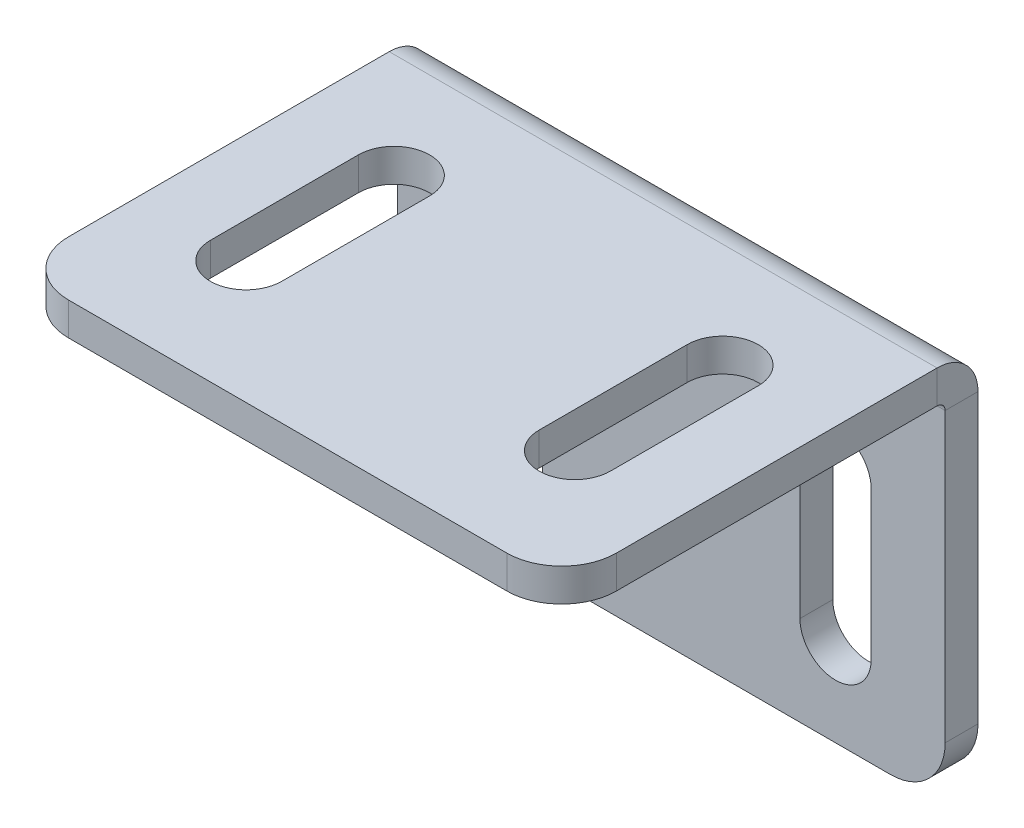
ISO-10303-21;
HEADER;
FILE_DESCRIPTION(('STEP AP214'),'2;1');
FILE_NAME('part.step','',(''),(''),'','','');
FILE_SCHEMA(('AUTOMOTIVE_DESIGN { 1 0 10303 214 1 1 1 1 }'));
ENDSEC;
DATA;
#1=APPLICATION_CONTEXT('core data for automotive mechanical design processes');
#2=APPLICATION_PROTOCOL_DEFINITION('international standard','automotive_design',2000,#1);
#3=PRODUCT_CONTEXT('',#1,'mechanical');
#4=PRODUCT('Part','Part','',(#3));
#5=PRODUCT_RELATED_PRODUCT_CATEGORY('part','',(#4));
#6=PRODUCT_DEFINITION_FORMATION('','',#4);
#7=PRODUCT_DEFINITION_CONTEXT('part definition',#1,'design');
#8=PRODUCT_DEFINITION('design','',#6,#7);
#9=PRODUCT_DEFINITION_SHAPE('','',#8);
#10=(LENGTH_UNIT() NAMED_UNIT(*) SI_UNIT(.MILLI.,.METRE.));
#11=(NAMED_UNIT(*) PLANE_ANGLE_UNIT() SI_UNIT($,.RADIAN.));
#12=(NAMED_UNIT(*) SI_UNIT($,.STERADIAN.) SOLID_ANGLE_UNIT());
#13=UNCERTAINTY_MEASURE_WITH_UNIT(LENGTH_MEASURE(1.E-05),#10,'distance_accuracy_value','');
#14=(GEOMETRIC_REPRESENTATION_CONTEXT(3) GLOBAL_UNCERTAINTY_ASSIGNED_CONTEXT((#13)) GLOBAL_UNIT_ASSIGNED_CONTEXT((#10,
#11,#12)) REPRESENTATION_CONTEXT('',''));
#15=CARTESIAN_POINT('',(0.,0.,0.));
#16=DIRECTION('',(0.,0.,1.));
#17=DIRECTION('',(1.,0.,0.));
#18=AXIS2_PLACEMENT_3D('',#15,#16,#17);
#19=CARTESIAN_POINT('',(0.,0.,3.));
#20=DIRECTION('',(1.,0.,0.));
#21=DIRECTION('',(0.,0.,-1.));
#22=AXIS2_PLACEMENT_3D('',#19,#20,#21);
#23=PLANE('',#22);
#24=DIRECTION('',(0.,-1.,0.));
#25=VECTOR('',#24,1.);
#26=CARTESIAN_POINT('',(0.,0.,0.));
#27=LINE('',#26,#25);
#28=CARTESIAN_POINT('',(0.,31.2634,0.));
#29=VERTEX_POINT('',#28);
#30=CARTESIAN_POINT('',(0.,5.,0.));
#31=VERTEX_POINT('',#30);
#32=EDGE_CURVE('E418',#29,#31,#27,.T.);
#33=ORIENTED_EDGE('',*,*,#32,.T.);
#34=DIRECTION('',(0.,0.,-1.));
#35=VECTOR('',#34,1.);
#36=CARTESIAN_POINT('',(0.,5.,3.));
#37=LINE('',#36,#35);
#38=CARTESIAN_POINT('',(0.,5.,3.));
#39=VERTEX_POINT('',#38);
#40=EDGE_CURVE('E452',#31,#39,#37,.F.);
#41=ORIENTED_EDGE('',*,*,#40,.T.);
#42=DIRECTION('',(0.,-1.,0.));
#43=VECTOR('',#42,1.);
#44=CARTESIAN_POINT('',(0.,0.,3.));
#45=LINE('',#44,#43);
#46=CARTESIAN_POINT('',(0.,31.2634,3.00000000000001));
#47=VERTEX_POINT('',#46);
#48=EDGE_CURVE('E421',#47,#39,#45,.T.);
#49=ORIENTED_EDGE('',*,*,#48,.F.);
#50=DIRECTION('',(0.,0.,-1.));
#51=VECTOR('',#50,1.);
#52=CARTESIAN_POINT('',(0.,31.2634,3.00000000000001));
#53=LINE('',#52,#51);
#54=EDGE_CURVE('E404',#47,#29,#53,.T.);
#55=ORIENTED_EDGE('',*,*,#54,.T.);
#56=EDGE_LOOP('',(#33,#41,#49,#55));
#57=FACE_BOUND('',#56,.T.);
#58=ADVANCED_FACE('F54',(#57),#23,.F.);
#59=CARTESIAN_POINT('',(50.,0.,3.));
#60=DIRECTION('',(-1.,0.,0.));
#61=DIRECTION('',(0.,0.,1.));
#62=AXIS2_PLACEMENT_3D('',#59,#60,#61);
#63=PLANE('',#62);
#64=DIRECTION('',(0.,1.,0.));
#65=VECTOR('',#64,1.);
#66=CARTESIAN_POINT('',(50.,0.,3.));
#67=LINE('',#66,#65);
#68=CARTESIAN_POINT('',(50.,5.,3.));
#69=VERTEX_POINT('',#68);
#70=CARTESIAN_POINT('',(50.,31.2634,3.00000000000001));
#71=VERTEX_POINT('',#70);
#72=EDGE_CURVE('E428',#69,#71,#67,.T.);
#73=ORIENTED_EDGE('',*,*,#72,.F.);
#74=DIRECTION('',(0.,0.,-1.));
#75=VECTOR('',#74,1.);
#76=CARTESIAN_POINT('',(50.,5.,3.));
#77=LINE('',#76,#75);
#78=CARTESIAN_POINT('',(50.,5.,0.));
#79=VERTEX_POINT('',#78);
#80=EDGE_CURVE('E430',#69,#79,#77,.T.);
#81=ORIENTED_EDGE('',*,*,#80,.T.);
#82=DIRECTION('',(0.,1.,0.));
#83=VECTOR('',#82,1.);
#84=CARTESIAN_POINT('',(50.,0.,0.));
#85=LINE('',#84,#83);
#86=CARTESIAN_POINT('',(50.,31.2634,0.));
#87=VERTEX_POINT('',#86);
#88=EDGE_CURVE('E425',#79,#87,#85,.T.);
#89=ORIENTED_EDGE('',*,*,#88,.T.);
#90=DIRECTION('',(0.,0.,-1.));
#91=VECTOR('',#90,1.);
#92=CARTESIAN_POINT('',(50.,31.2634,3.00000000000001));
#93=LINE('',#92,#91);
#94=EDGE_CURVE('E415',#71,#87,#93,.T.);
#95=ORIENTED_EDGE('',*,*,#94,.F.);
#96=EDGE_LOOP('',(#73,#81,#89,#95));
#97=FACE_BOUND('',#96,.T.);
#98=ADVANCED_FACE('F530',(#97),#63,.F.);
#99=CARTESIAN_POINT('',(0.,35.,3.));
#100=DIRECTION('',(0.,0.,-1.));
#101=DIRECTION('',(-1.,0.,0.));
#102=AXIS2_PLACEMENT_3D('',#99,#100,#101);
#103=PLANE('',#102);
#104=DIRECTION('',(0.,1.,0.));
#105=VECTOR('',#104,1.);
#106=CARTESIAN_POINT('',(13.25,8.20000000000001,3.));
#107=LINE('',#106,#105);
#108=CARTESIAN_POINT('',(13.25,8.20000000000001,3.));
#109=VERTEX_POINT('',#108);
#110=CARTESIAN_POINT('',(13.25,21.7,3.));
#111=VERTEX_POINT('',#110);
#112=EDGE_CURVE('E258',#109,#111,#107,.T.);
#113=ORIENTED_EDGE('',*,*,#112,.F.);
#114=CARTESIAN_POINT('',(10.,8.20000000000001,3.));
#115=DIRECTION('',(0.,0.,-1.));
#116=DIRECTION('',(-1.,0.,0.));
#117=AXIS2_PLACEMENT_3D('',#114,#115,#116);
#118=CIRCLE('',#117,3.25);
#119=CARTESIAN_POINT('',(6.75,8.20000000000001,3.));
#120=VERTEX_POINT('',#119);
#121=EDGE_CURVE('E240',#120,#109,#118,.F.);
#122=ORIENTED_EDGE('',*,*,#121,.F.);
#123=DIRECTION('',(0.,-1.,0.));
#124=VECTOR('',#123,1.);
#125=CARTESIAN_POINT('',(6.75,8.20000000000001,3.));
#126=LINE('',#125,#124);
#127=CARTESIAN_POINT('',(6.75,21.7,3.));
#128=VERTEX_POINT('',#127);
#129=EDGE_CURVE('E249',#128,#120,#126,.T.);
#130=ORIENTED_EDGE('',*,*,#129,.F.);
#131=CARTESIAN_POINT('',(10.,21.7,3.));
#132=DIRECTION('',(0.,0.,-1.));
#133=DIRECTION('',(-1.,0.,0.));
#134=AXIS2_PLACEMENT_3D('',#131,#132,#133);
#135=CIRCLE('',#134,3.25);
#136=EDGE_CURVE('E69',#111,#128,#135,.F.);
#137=ORIENTED_EDGE('',*,*,#136,.F.);
#138=EDGE_LOOP('',(#113,#122,#130,#137));
#139=FACE_BOUND('',#138,.T.);
#140=DIRECTION('',(0.,1.,0.));
#141=VECTOR('',#140,1.);
#142=CARTESIAN_POINT('',(43.25,8.2,3.));
#143=LINE('',#142,#141);
#144=CARTESIAN_POINT('',(43.25,8.2,3.));
#145=VERTEX_POINT('',#144);
#146=CARTESIAN_POINT('',(43.25,21.7,3.));
#147=VERTEX_POINT('',#146);
#148=EDGE_CURVE('E276',#145,#147,#143,.T.);
#149=ORIENTED_EDGE('',*,*,#148,.F.);
#150=CARTESIAN_POINT('',(40.,8.2,3.));
#151=DIRECTION('',(0.,0.,-1.));
#152=DIRECTION('',(-1.,0.,0.));
#153=AXIS2_PLACEMENT_3D('',#150,#151,#152);
#154=CIRCLE('',#153,3.25);
#155=CARTESIAN_POINT('',(36.75,8.2,3.));
#156=VERTEX_POINT('',#155);
#157=EDGE_CURVE('E279',#156,#145,#154,.F.);
#158=ORIENTED_EDGE('',*,*,#157,.F.);
#159=DIRECTION('',(0.,-1.,0.));
#160=VECTOR('',#159,1.);
#161=CARTESIAN_POINT('',(36.75,8.2,3.));
#162=LINE('',#161,#160);
#163=CARTESIAN_POINT('',(36.75,21.7,3.));
#164=VERTEX_POINT('',#163);
#165=EDGE_CURVE('E296',#164,#156,#162,.T.);
#166=ORIENTED_EDGE('',*,*,#165,.F.);
#167=CARTESIAN_POINT('',(40.,21.7,3.));
#168=DIRECTION('',(0.,0.,-1.));
#169=DIRECTION('',(-1.,0.,0.));
#170=AXIS2_PLACEMENT_3D('',#167,#168,#169);
#171=CIRCLE('',#170,3.25);
#172=EDGE_CURVE('E252',#147,#164,#171,.F.);
#173=ORIENTED_EDGE('',*,*,#172,.F.);
#174=EDGE_LOOP('',(#149,#158,#166,#173));
#175=FACE_BOUND('',#174,.T.);
#176=DIRECTION('',(1.,0.,0.));
#177=VECTOR('',#176,1.);
#178=CARTESIAN_POINT('',(0.,0.,3.));
#179=LINE('',#178,#177);
#180=CARTESIAN_POINT('',(5.,0.,3.));
#181=VERTEX_POINT('',#180);
#182=CARTESIAN_POINT('',(45.,0.,3.));
#183=VERTEX_POINT('',#182);
#184=EDGE_CURVE('E424',#181,#183,#179,.T.);
#185=ORIENTED_EDGE('',*,*,#184,.T.);
#186=CARTESIAN_POINT('',(45.,5.,3.));
#187=DIRECTION('',(0.,0.,-1.));
#188=DIRECTION('',(-1.,0.,0.));
#189=AXIS2_PLACEMENT_3D('',#186,#187,#188);
#190=CIRCLE('',#189,5.);
#191=EDGE_CURVE('E450',#183,#69,#190,.F.);
#192=ORIENTED_EDGE('',*,*,#191,.T.);
#193=ORIENTED_EDGE('',*,*,#72,.T.);
#194=DIRECTION('',(-1.,0.,0.));
#195=VECTOR('',#194,1.);
#196=CARTESIAN_POINT('',(0.,31.2634,3.00000000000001));
#197=LINE('',#196,#195);
#198=EDGE_CURVE('E410',#47,#71,#197,.F.);
#199=ORIENTED_EDGE('',*,*,#198,.F.);
#200=ORIENTED_EDGE('',*,*,#48,.T.);
#201=CARTESIAN_POINT('',(5.,5.,3.));
#202=DIRECTION('',(0.,0.,-1.));
#203=DIRECTION('',(-1.,0.,0.));
#204=AXIS2_PLACEMENT_3D('',#201,#202,#203);
#205=CIRCLE('',#204,5.);
#206=EDGE_CURVE('E448',#39,#181,#205,.F.);
#207=ORIENTED_EDGE('',*,*,#206,.T.);
#208=EDGE_LOOP('',(#185,#192,#193,#199,#200,#207));
#209=FACE_BOUND('',#208,.T.);
#210=ADVANCED_FACE('F255',(#139,#175,#209),#103,.F.);
#211=CARTESIAN_POINT('',(0.,35.,0.));
#212=DIRECTION('',(0.,0.,-1.));
#213=DIRECTION('',(-1.,0.,0.));
#214=AXIS2_PLACEMENT_3D('',#211,#212,#213);
#215=PLANE('',#214);
#216=CARTESIAN_POINT('',(10.,8.20000000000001,0.));
#217=DIRECTION('',(0.,0.,-1.));
#218=DIRECTION('',(-1.,0.,0.));
#219=AXIS2_PLACEMENT_3D('',#216,#217,#218);
#220=CIRCLE('',#219,3.25);
#221=CARTESIAN_POINT('',(13.25,8.20000000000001,0.));
#222=VERTEX_POINT('',#221);
#223=CARTESIAN_POINT('',(6.75,8.20000000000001,0.));
#224=VERTEX_POINT('',#223);
#225=EDGE_CURVE('E77',#222,#224,#220,.T.);
#226=ORIENTED_EDGE('',*,*,#225,.F.);
#227=DIRECTION('',(0.,-1.,0.));
#228=VECTOR('',#227,1.);
#229=CARTESIAN_POINT('',(13.25,8.20000000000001,0.));
#230=LINE('',#229,#228);
#231=CARTESIAN_POINT('',(13.25,21.7,0.));
#232=VERTEX_POINT('',#231);
#233=EDGE_CURVE('E246',#232,#222,#230,.T.);
#234=ORIENTED_EDGE('',*,*,#233,.F.);
#235=CARTESIAN_POINT('',(10.,21.7,0.));
#236=DIRECTION('',(0.,0.,-1.));
#237=DIRECTION('',(-1.,0.,0.));
#238=AXIS2_PLACEMENT_3D('',#235,#236,#237);
#239=CIRCLE('',#238,3.25);
#240=CARTESIAN_POINT('',(6.75,21.7,0.));
#241=VERTEX_POINT('',#240);
#242=EDGE_CURVE('E266',#241,#232,#239,.T.);
#243=ORIENTED_EDGE('',*,*,#242,.F.);
#244=DIRECTION('',(0.,1.,0.));
#245=VECTOR('',#244,1.);
#246=CARTESIAN_POINT('',(6.75,8.20000000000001,0.));
#247=LINE('',#246,#245);
#248=EDGE_CURVE('E260',#224,#241,#247,.T.);
#249=ORIENTED_EDGE('',*,*,#248,.F.);
#250=EDGE_LOOP('',(#226,#234,#243,#249));
#251=FACE_BOUND('',#250,.T.);
#252=CARTESIAN_POINT('',(40.,8.2,0.));
#253=DIRECTION('',(0.,0.,-1.));
#254=DIRECTION('',(-1.,0.,0.));
#255=AXIS2_PLACEMENT_3D('',#252,#253,#254);
#256=CIRCLE('',#255,3.25);
#257=CARTESIAN_POINT('',(43.25,8.2,0.));
#258=VERTEX_POINT('',#257);
#259=CARTESIAN_POINT('',(36.75,8.20000000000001,0.));
#260=VERTEX_POINT('',#259);
#261=EDGE_CURVE('E282',#258,#260,#256,.T.);
#262=ORIENTED_EDGE('',*,*,#261,.F.);
#263=DIRECTION('',(0.,-1.,0.));
#264=VECTOR('',#263,1.);
#265=CARTESIAN_POINT('',(43.25,8.2,0.));
#266=LINE('',#265,#264);
#267=CARTESIAN_POINT('',(43.25,21.7,0.));
#268=VERTEX_POINT('',#267);
#269=EDGE_CURVE('E290',#268,#258,#266,.T.);
#270=ORIENTED_EDGE('',*,*,#269,.F.);
#271=CARTESIAN_POINT('',(40.,21.7,0.));
#272=DIRECTION('',(0.,0.,-1.));
#273=DIRECTION('',(-1.,0.,0.));
#274=AXIS2_PLACEMENT_3D('',#271,#272,#273);
#275=CIRCLE('',#274,3.25);
#276=CARTESIAN_POINT('',(36.75,21.7,0.));
#277=VERTEX_POINT('',#276);
#278=EDGE_CURVE('E287',#277,#268,#275,.T.);
#279=ORIENTED_EDGE('',*,*,#278,.F.);
#280=DIRECTION('',(0.,1.,0.));
#281=VECTOR('',#280,1.);
#282=CARTESIAN_POINT('',(36.75,8.2,0.));
#283=LINE('',#282,#281);
#284=EDGE_CURVE('E284',#260,#277,#283,.T.);
#285=ORIENTED_EDGE('',*,*,#284,.F.);
#286=EDGE_LOOP('',(#262,#270,#279,#285));
#287=FACE_BOUND('',#286,.T.);
#288=ORIENTED_EDGE('',*,*,#88,.F.);
#289=CARTESIAN_POINT('',(45.,5.,0.));
#290=DIRECTION('',(0.,0.,-1.));
#291=DIRECTION('',(-1.,0.,0.));
#292=AXIS2_PLACEMENT_3D('',#289,#290,#291);
#293=CIRCLE('',#292,5.);
#294=CARTESIAN_POINT('',(45.,0.,0.));
#295=VERTEX_POINT('',#294);
#296=EDGE_CURVE('E441',#79,#295,#293,.T.);
#297=ORIENTED_EDGE('',*,*,#296,.T.);
#298=DIRECTION('',(1.,0.,0.));
#299=VECTOR('',#298,1.);
#300=CARTESIAN_POINT('',(0.,0.,0.));
#301=LINE('',#300,#299);
#302=CARTESIAN_POINT('',(5.,0.,0.));
#303=VERTEX_POINT('',#302);
#304=EDGE_CURVE('E433',#303,#295,#301,.T.);
#305=ORIENTED_EDGE('',*,*,#304,.F.);
#306=CARTESIAN_POINT('',(5.,5.,0.));
#307=DIRECTION('',(0.,0.,-1.));
#308=DIRECTION('',(-1.,0.,0.));
#309=AXIS2_PLACEMENT_3D('',#306,#307,#308);
#310=CIRCLE('',#309,5.);
#311=EDGE_CURVE('E439',#303,#31,#310,.T.);
#312=ORIENTED_EDGE('',*,*,#311,.T.);
#313=ORIENTED_EDGE('',*,*,#32,.F.);
#314=DIRECTION('',(-1.,0.,0.));
#315=VECTOR('',#314,1.);
#316=CARTESIAN_POINT('',(0.,31.2634,0.));
#317=LINE('',#316,#315);
#318=EDGE_CURVE('E397',#29,#87,#317,.F.);
#319=ORIENTED_EDGE('',*,*,#318,.T.);
#320=EDGE_LOOP('',(#288,#297,#305,#312,#313,#319));
#321=FACE_BOUND('',#320,.T.);
#322=ADVANCED_FACE('F511',(#251,#287,#321),#215,.T.);
#323=CARTESIAN_POINT('',(0.,0.,3.));
#324=DIRECTION('',(0.,1.,0.));
#325=DIRECTION('',(0.,0.,1.));
#326=AXIS2_PLACEMENT_3D('',#323,#324,#325);
#327=PLANE('',#326);
#328=ORIENTED_EDGE('',*,*,#304,.T.);
#329=DIRECTION('',(0.,0.,-1.));
#330=VECTOR('',#329,1.);
#331=CARTESIAN_POINT('',(45.,0.,3.));
#332=LINE('',#331,#330);
#333=EDGE_CURVE('E446',#295,#183,#332,.F.);
#334=ORIENTED_EDGE('',*,*,#333,.T.);
#335=ORIENTED_EDGE('',*,*,#184,.F.);
#336=DIRECTION('',(0.,0.,-1.));
#337=VECTOR('',#336,1.);
#338=CARTESIAN_POINT('',(5.,0.,3.));
#339=LINE('',#338,#337);
#340=EDGE_CURVE('E443',#181,#303,#339,.T.);
#341=ORIENTED_EDGE('',*,*,#340,.T.);
#342=EDGE_LOOP('',(#328,#334,#335,#341));
#343=FACE_BOUND('',#342,.T.);
#344=ADVANCED_FACE('F525',(#343),#327,.F.);
#345=CARTESIAN_POINT('',(50.,31.2634,3.7366));
#346=DIRECTION('',(1.,0.,0.));
#347=DIRECTION('',(0.,0.,-1.));
#348=AXIS2_PLACEMENT_3D('',#345,#346,#347);
#349=PLANE('',#348);
#350=DIRECTION('',(0.,-1.,0.));
#351=VECTOR('',#350,1.);
#352=CARTESIAN_POINT('',(50.,35.,3.73659999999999));
#353=LINE('',#352,#351);
#354=CARTESIAN_POINT('',(50.,32.,3.7366));
#355=VERTEX_POINT('',#354);
#356=CARTESIAN_POINT('',(50.,35.,3.73659999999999));
#357=VERTEX_POINT('',#356);
#358=EDGE_CURVE('E369',#355,#357,#353,.F.);
#359=ORIENTED_EDGE('',*,*,#358,.F.);
#360=CARTESIAN_POINT('',(50.,31.2634,3.7366));
#361=DIRECTION('',(-1.,0.,0.));
#362=DIRECTION('',(0.,0.,1.));
#363=AXIS2_PLACEMENT_3D('',#360,#361,#362);
#364=CIRCLE('',#363,0.736599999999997);
#365=EDGE_CURVE('E407',#71,#355,#364,.F.);
#366=ORIENTED_EDGE('',*,*,#365,.F.);
#367=ORIENTED_EDGE('',*,*,#94,.T.);
#368=CARTESIAN_POINT('',(50.,31.2634,3.7366));
#369=DIRECTION('',(-1.,0.,0.));
#370=DIRECTION('',(0.,0.,1.));
#371=AXIS2_PLACEMENT_3D('',#368,#369,#370);
#372=CIRCLE('',#371,3.7366);
#373=EDGE_CURVE('E400',#87,#357,#372,.F.);
#374=ORIENTED_EDGE('',*,*,#373,.T.);
#375=EDGE_LOOP('',(#359,#366,#367,#374));
#376=FACE_BOUND('',#375,.T.);
#377=ADVANCED_FACE('F503',(#376),#349,.T.);
#378=CARTESIAN_POINT('',(0.,31.2634,3.7366));
#379=DIRECTION('',(1.,0.,0.));
#380=DIRECTION('',(0.,0.,-1.));
#381=AXIS2_PLACEMENT_3D('',#378,#379,#380);
#382=PLANE('',#381);
#383=CARTESIAN_POINT('',(0.,31.2634,3.7366));
#384=DIRECTION('',(-1.,0.,0.));
#385=DIRECTION('',(0.,0.,1.));
#386=AXIS2_PLACEMENT_3D('',#383,#384,#385);
#387=CIRCLE('',#386,0.736599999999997);
#388=CARTESIAN_POINT('',(0.,32.,3.7366));
#389=VERTEX_POINT('',#388);
#390=EDGE_CURVE('E373',#389,#47,#387,.T.);
#391=ORIENTED_EDGE('',*,*,#390,.F.);
#392=DIRECTION('',(0.,-1.,0.));
#393=VECTOR('',#392,1.);
#394=CARTESIAN_POINT('',(0.,32.,3.7366));
#395=LINE('',#394,#393);
#396=CARTESIAN_POINT('',(0.,35.,3.73659999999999));
#397=VERTEX_POINT('',#396);
#398=EDGE_CURVE('E390',#389,#397,#395,.F.);
#399=ORIENTED_EDGE('',*,*,#398,.T.);
#400=CARTESIAN_POINT('',(0.,31.2634,3.7366));
#401=DIRECTION('',(-1.,0.,0.));
#402=DIRECTION('',(0.,0.,1.));
#403=AXIS2_PLACEMENT_3D('',#400,#401,#402);
#404=CIRCLE('',#403,3.7366);
#405=EDGE_CURVE('E401',#397,#29,#404,.T.);
#406=ORIENTED_EDGE('',*,*,#405,.T.);
#407=ORIENTED_EDGE('',*,*,#54,.F.);
#408=EDGE_LOOP('',(#391,#399,#406,#407));
#409=FACE_BOUND('',#408,.T.);
#410=ADVANCED_FACE('F498',(#409),#382,.F.);
#411=CARTESIAN_POINT('',(0.,31.2634,3.7366));
#412=DIRECTION('',(-1.,0.,0.));
#413=DIRECTION('',(0.,1.,0.));
#414=AXIS2_PLACEMENT_3D('',#411,#412,#413);
#415=CYLINDRICAL_SURFACE('',#414,3.7366);
#416=ORIENTED_EDGE('',*,*,#318,.F.);
#417=ORIENTED_EDGE('',*,*,#405,.F.);
#418=DIRECTION('',(-1.,0.,0.));
#419=VECTOR('',#418,1.);
#420=CARTESIAN_POINT('',(50.,35.,3.73659999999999));
#421=LINE('',#420,#419);
#422=EDGE_CURVE('E387',#397,#357,#421,.F.);
#423=ORIENTED_EDGE('',*,*,#422,.T.);
#424=ORIENTED_EDGE('',*,*,#373,.F.);
#425=EDGE_LOOP('',(#416,#417,#423,#424));
#426=FACE_BOUND('',#425,.T.);
#427=ADVANCED_FACE('F501',(#426),#415,.T.);
#428=CARTESIAN_POINT('',(0.,31.2634,3.7366));
#429=DIRECTION('',(-1.,0.,0.));
#430=DIRECTION('',(0.,1.,0.));
#431=AXIS2_PLACEMENT_3D('',#428,#429,#430);
#432=CYLINDRICAL_SURFACE('',#431,0.736599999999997);
#433=ORIENTED_EDGE('',*,*,#198,.T.);
#434=ORIENTED_EDGE('',*,*,#365,.T.);
#435=DIRECTION('',(-1.,0.,0.));
#436=VECTOR('',#435,1.);
#437=CARTESIAN_POINT('',(50.,32.,3.7366));
#438=LINE('',#437,#436);
#439=EDGE_CURVE('E393',#355,#389,#438,.T.);
#440=ORIENTED_EDGE('',*,*,#439,.T.);
#441=ORIENTED_EDGE('',*,*,#390,.T.);
#442=EDGE_LOOP('',(#433,#434,#440,#441));
#443=FACE_BOUND('',#442,.T.);
#444=ADVANCED_FACE('F579',(#443),#432,.F.);
#445=CARTESIAN_POINT('',(50.,35.,2.99999999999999));
#446=DIRECTION('',(-1.,0.,0.));
#447=DIRECTION('',(0.,0.,1.));
#448=AXIS2_PLACEMENT_3D('',#445,#446,#447);
#449=PLANE('',#448);
#450=DIRECTION('',(0.,0.,-1.));
#451=VECTOR('',#450,1.);
#452=CARTESIAN_POINT('',(50.,35.0000000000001,38.));
#453=LINE('',#452,#451);
#454=CARTESIAN_POINT('',(50.,35.0000000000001,33.));
#455=VERTEX_POINT('',#454);
#456=EDGE_CURVE('E377',#455,#357,#453,.T.);
#457=ORIENTED_EDGE('',*,*,#456,.F.);
#458=DIRECTION('',(0.,-1.,0.));
#459=VECTOR('',#458,1.);
#460=CARTESIAN_POINT('',(50.,35.0000000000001,33.));
#461=LINE('',#460,#459);
#462=CARTESIAN_POINT('',(50.,32.0000000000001,33.));
#463=VERTEX_POINT('',#462);
#464=EDGE_CURVE('E454',#455,#463,#461,.T.);
#465=ORIENTED_EDGE('',*,*,#464,.T.);
#466=DIRECTION('',(0.,0.,1.));
#467=VECTOR('',#466,1.);
#468=CARTESIAN_POINT('',(50.,32.,3.));
#469=LINE('',#468,#467);
#470=EDGE_CURVE('E385',#463,#355,#469,.F.);
#471=ORIENTED_EDGE('',*,*,#470,.T.);
#472=ORIENTED_EDGE('',*,*,#358,.T.);
#473=EDGE_LOOP('',(#457,#465,#471,#472));
#474=FACE_BOUND('',#473,.T.);
#475=ADVANCED_FACE('F477',(#474),#449,.F.);
#476=CARTESIAN_POINT('',(0.,35.0000000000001,38.));
#477=DIRECTION('',(1.,0.,0.));
#478=DIRECTION('',(0.,0.,-1.));
#479=AXIS2_PLACEMENT_3D('',#476,#477,#478);
#480=PLANE('',#479);
#481=DIRECTION('',(0.,0.,-1.));
#482=VECTOR('',#481,1.);
#483=CARTESIAN_POINT('',(0.,32.0000000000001,38.));
#484=LINE('',#483,#482);
#485=CARTESIAN_POINT('',(0.,32.0000000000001,33.));
#486=VERTEX_POINT('',#485);
#487=EDGE_CURVE('E382',#389,#486,#484,.F.);
#488=ORIENTED_EDGE('',*,*,#487,.T.);
#489=DIRECTION('',(0.,-1.,0.));
#490=VECTOR('',#489,1.);
#491=CARTESIAN_POINT('',(0.,35.0000000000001,33.));
#492=LINE('',#491,#490);
#493=CARTESIAN_POINT('',(0.,35.0000000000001,33.));
#494=VERTEX_POINT('',#493);
#495=EDGE_CURVE('E13',#486,#494,#492,.F.);
#496=ORIENTED_EDGE('',*,*,#495,.T.);
#497=DIRECTION('',(0.,0.,1.));
#498=VECTOR('',#497,1.);
#499=CARTESIAN_POINT('',(0.,35.0000000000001,38.));
#500=LINE('',#499,#498);
#501=EDGE_CURVE('E374',#397,#494,#500,.T.);
#502=ORIENTED_EDGE('',*,*,#501,.F.);
#503=ORIENTED_EDGE('',*,*,#398,.F.);
#504=EDGE_LOOP('',(#488,#496,#502,#503));
#505=FACE_BOUND('',#504,.T.);
#506=ADVANCED_FACE('F494',(#505),#480,.F.);
#507=CARTESIAN_POINT('',(50.,35.0000000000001,38.));
#508=DIRECTION('',(0.,-1.,0.));
#509=DIRECTION('',(0.,0.,-1.));
#510=AXIS2_PLACEMENT_3D('',#507,#508,#509);
#511=PLANE('',#510);
#512=DIRECTION('',(0.,0.,-1.));
#513=VECTOR('',#512,1.);
#514=CARTESIAN_POINT('',(43.25,35.0000000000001,26.8));
#515=LINE('',#514,#513);
#516=CARTESIAN_POINT('',(43.25,35.0000000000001,26.8));
#517=VERTEX_POINT('',#516);
#518=CARTESIAN_POINT('',(43.25,35.,13.3));
#519=VERTEX_POINT('',#518);
#520=EDGE_CURVE('E316',#517,#519,#515,.T.);
#521=ORIENTED_EDGE('',*,*,#520,.F.);
#522=CARTESIAN_POINT('',(40.,35.0000000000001,26.8));
#523=DIRECTION('',(0.,1.,0.));
#524=DIRECTION('',(0.,0.,1.));
#525=AXIS2_PLACEMENT_3D('',#522,#523,#524);
#526=CIRCLE('',#525,3.25);
#527=CARTESIAN_POINT('',(36.75,35.0000000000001,26.8));
#528=VERTEX_POINT('',#527);
#529=EDGE_CURVE('E314',#528,#517,#526,.T.);
#530=ORIENTED_EDGE('',*,*,#529,.F.);
#531=DIRECTION('',(0.,0.,1.));
#532=VECTOR('',#531,1.);
#533=CARTESIAN_POINT('',(36.75,35.0000000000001,26.8));
#534=LINE('',#533,#532);
#535=CARTESIAN_POINT('',(36.75,35.,13.3));
#536=VERTEX_POINT('',#535);
#537=EDGE_CURVE('E322',#536,#528,#534,.T.);
#538=ORIENTED_EDGE('',*,*,#537,.F.);
#539=CARTESIAN_POINT('',(40.,35.,13.3));
#540=DIRECTION('',(0.,1.,0.));
#541=DIRECTION('',(0.,0.,1.));
#542=AXIS2_PLACEMENT_3D('',#539,#540,#541);
#543=CIRCLE('',#542,3.25);
#544=EDGE_CURVE('E319',#519,#536,#543,.T.);
#545=ORIENTED_EDGE('',*,*,#544,.F.);
#546=EDGE_LOOP('',(#521,#530,#538,#545));
#547=FACE_BOUND('',#546,.T.);
#548=DIRECTION('',(0.,0.,-1.));
#549=VECTOR('',#548,1.);
#550=CARTESIAN_POINT('',(13.25,35.0000000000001,26.8));
#551=LINE('',#550,#549);
#552=CARTESIAN_POINT('',(13.25,35.0000000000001,26.8));
#553=VERTEX_POINT('',#552);
#554=CARTESIAN_POINT('',(13.25,35.,13.3));
#555=VERTEX_POINT('',#554);
#556=EDGE_CURVE('E348',#553,#555,#551,.T.);
#557=ORIENTED_EDGE('',*,*,#556,.F.);
#558=CARTESIAN_POINT('',(10.,35.0000000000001,26.8));
#559=DIRECTION('',(0.,1.,0.));
#560=DIRECTION('',(0.,0.,1.));
#561=AXIS2_PLACEMENT_3D('',#558,#559,#560);
#562=CIRCLE('',#561,3.25);
#563=CARTESIAN_POINT('',(6.75,35.0000000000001,26.8));
#564=VERTEX_POINT('',#563);
#565=EDGE_CURVE('E346',#564,#553,#562,.T.);
#566=ORIENTED_EDGE('',*,*,#565,.F.);
#567=DIRECTION('',(0.,0.,1.));
#568=VECTOR('',#567,1.);
#569=CARTESIAN_POINT('',(6.75,35.0000000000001,26.8));
#570=LINE('',#569,#568);
#571=CARTESIAN_POINT('',(6.75,35.,13.3));
#572=VERTEX_POINT('',#571);
#573=EDGE_CURVE('E354',#572,#564,#570,.T.);
#574=ORIENTED_EDGE('',*,*,#573,.F.);
#575=CARTESIAN_POINT('',(10.,35.,13.3));
#576=DIRECTION('',(0.,1.,0.));
#577=DIRECTION('',(0.,0.,1.));
#578=AXIS2_PLACEMENT_3D('',#575,#576,#577);
#579=CIRCLE('',#578,3.25);
#580=EDGE_CURVE('E351',#555,#572,#579,.T.);
#581=ORIENTED_EDGE('',*,*,#580,.F.);
#582=EDGE_LOOP('',(#557,#566,#574,#581));
#583=FACE_BOUND('',#582,.T.);
#584=DIRECTION('',(1.,0.,0.));
#585=VECTOR('',#584,1.);
#586=CARTESIAN_POINT('',(50.,35.0000000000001,38.));
#587=LINE('',#586,#585);
#588=CARTESIAN_POINT('',(5.,35.0000000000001,38.));
#589=VERTEX_POINT('',#588);
#590=CARTESIAN_POINT('',(45.,35.0000000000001,38.));
#591=VERTEX_POINT('',#590);
#592=EDGE_CURVE('E370',#589,#591,#587,.T.);
#593=ORIENTED_EDGE('',*,*,#592,.T.);
#594=CARTESIAN_POINT('',(45.,35.0000000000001,33.));
#595=DIRECTION('',(0.,-1.,0.));
#596=DIRECTION('',(0.,0.,-1.));
#597=AXIS2_PLACEMENT_3D('',#594,#595,#596);
#598=CIRCLE('',#597,5.);
#599=EDGE_CURVE('E62',#591,#455,#598,.F.);
#600=ORIENTED_EDGE('',*,*,#599,.T.);
#601=ORIENTED_EDGE('',*,*,#456,.T.);
#602=ORIENTED_EDGE('',*,*,#422,.F.);
#603=ORIENTED_EDGE('',*,*,#501,.T.);
#604=CARTESIAN_POINT('',(5.,35.0000000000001,33.));
#605=DIRECTION('',(0.,-1.,0.));
#606=DIRECTION('',(0.,0.,-1.));
#607=AXIS2_PLACEMENT_3D('',#604,#605,#606);
#608=CIRCLE('',#607,5.);
#609=EDGE_CURVE('E466',#494,#589,#608,.F.);
#610=ORIENTED_EDGE('',*,*,#609,.T.);
#611=EDGE_LOOP('',(#593,#600,#601,#602,#603,#610));
#612=FACE_BOUND('',#611,.T.);
#613=ADVANCED_FACE('F470',(#547,#583,#612),#511,.F.);
#614=CARTESIAN_POINT('',(50.,32.0000000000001,38.));
#615=DIRECTION('',(0.,-1.,0.));
#616=DIRECTION('',(0.,0.,-1.));
#617=AXIS2_PLACEMENT_3D('',#614,#615,#616);
#618=PLANE('',#617);
#619=CARTESIAN_POINT('',(40.,32.0000000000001,26.8));
#620=DIRECTION('',(0.,-1.,0.));
#621=DIRECTION('',(0.,0.,-1.));
#622=AXIS2_PLACEMENT_3D('',#619,#620,#621);
#623=CIRCLE('',#622,3.25);
#624=CARTESIAN_POINT('',(36.75,32.0000000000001,26.8000000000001));
#625=VERTEX_POINT('',#624);
#626=CARTESIAN_POINT('',(43.25,32.0000000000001,26.8000000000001));
#627=VERTEX_POINT('',#626);
#628=EDGE_CURVE('E311',#625,#627,#623,.F.);
#629=ORIENTED_EDGE('',*,*,#628,.T.);
#630=DIRECTION('',(0.,0.,-1.));
#631=VECTOR('',#630,1.);
#632=CARTESIAN_POINT('',(43.25,32.0000000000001,26.8));
#633=LINE('',#632,#631);
#634=CARTESIAN_POINT('',(43.25,32.,13.3));
#635=VERTEX_POINT('',#634);
#636=EDGE_CURVE('E328',#627,#635,#633,.T.);
#637=ORIENTED_EDGE('',*,*,#636,.T.);
#638=CARTESIAN_POINT('',(40.,32.,13.3));
#639=DIRECTION('',(0.,-1.,0.));
#640=DIRECTION('',(0.,0.,-1.));
#641=AXIS2_PLACEMENT_3D('',#638,#639,#640);
#642=CIRCLE('',#641,3.25);
#643=CARTESIAN_POINT('',(36.75,32.,13.3000000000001));
#644=VERTEX_POINT('',#643);
#645=EDGE_CURVE('E305',#635,#644,#642,.F.);
#646=ORIENTED_EDGE('',*,*,#645,.T.);
#647=DIRECTION('',(0.,0.,1.));
#648=VECTOR('',#647,1.);
#649=CARTESIAN_POINT('',(36.75,32.0000000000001,26.8));
#650=LINE('',#649,#648);
#651=EDGE_CURVE('E308',#644,#625,#650,.T.);
#652=ORIENTED_EDGE('',*,*,#651,.T.);
#653=EDGE_LOOP('',(#629,#637,#646,#652));
#654=FACE_BOUND('',#653,.T.);
#655=CARTESIAN_POINT('',(10.,32.0000000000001,26.8));
#656=DIRECTION('',(0.,-1.,0.));
#657=DIRECTION('',(0.,0.,-1.));
#658=AXIS2_PLACEMENT_3D('',#655,#656,#657);
#659=CIRCLE('',#658,3.25);
#660=CARTESIAN_POINT('',(6.75,32.0000000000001,26.8000000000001));
#661=VERTEX_POINT('',#660);
#662=CARTESIAN_POINT('',(13.25,32.0000000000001,26.8000000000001));
#663=VERTEX_POINT('',#662);
#664=EDGE_CURVE('E343',#661,#663,#659,.F.);
#665=ORIENTED_EDGE('',*,*,#664,.T.);
#666=DIRECTION('',(0.,0.,-1.));
#667=VECTOR('',#666,1.);
#668=CARTESIAN_POINT('',(13.25,32.0000000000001,26.8));
#669=LINE('',#668,#667);
#670=CARTESIAN_POINT('',(13.25,32.,13.3));
#671=VERTEX_POINT('',#670);
#672=EDGE_CURVE('E360',#663,#671,#669,.T.);
#673=ORIENTED_EDGE('',*,*,#672,.T.);
#674=CARTESIAN_POINT('',(10.,32.,13.3));
#675=DIRECTION('',(0.,-1.,0.));
#676=DIRECTION('',(0.,0.,-1.));
#677=AXIS2_PLACEMENT_3D('',#674,#675,#676);
#678=CIRCLE('',#677,3.25);
#679=CARTESIAN_POINT('',(6.75,32.,13.3000000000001));
#680=VERTEX_POINT('',#679);
#681=EDGE_CURVE('E337',#671,#680,#678,.F.);
#682=ORIENTED_EDGE('',*,*,#681,.T.);
#683=DIRECTION('',(0.,0.,1.));
#684=VECTOR('',#683,1.);
#685=CARTESIAN_POINT('',(6.75,32.0000000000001,26.8));
#686=LINE('',#685,#684);
#687=EDGE_CURVE('E340',#680,#661,#686,.T.);
#688=ORIENTED_EDGE('',*,*,#687,.T.);
#689=EDGE_LOOP('',(#665,#673,#682,#688));
#690=FACE_BOUND('',#689,.T.);
#691=ORIENTED_EDGE('',*,*,#470,.F.);
#692=CARTESIAN_POINT('',(45.,32.0000000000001,33.));
#693=DIRECTION('',(0.,-1.,0.));
#694=DIRECTION('',(0.,0.,-1.));
#695=AXIS2_PLACEMENT_3D('',#692,#693,#694);
#696=CIRCLE('',#695,5.);
#697=CARTESIAN_POINT('',(45.,32.0000000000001,38.));
#698=VERTEX_POINT('',#697);
#699=EDGE_CURVE('E459',#463,#698,#696,.T.);
#700=ORIENTED_EDGE('',*,*,#699,.T.);
#701=DIRECTION('',(-1.,0.,0.));
#702=VECTOR('',#701,1.);
#703=CARTESIAN_POINT('',(50.,32.0000000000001,38.));
#704=LINE('',#703,#702);
#705=CARTESIAN_POINT('',(5.,32.0000000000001,38.));
#706=VERTEX_POINT('',#705);
#707=EDGE_CURVE('E379',#706,#698,#704,.F.);
#708=ORIENTED_EDGE('',*,*,#707,.F.);
#709=CARTESIAN_POINT('',(5.,32.0000000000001,33.));
#710=DIRECTION('',(0.,-1.,0.));
#711=DIRECTION('',(0.,0.,-1.));
#712=AXIS2_PLACEMENT_3D('',#709,#710,#711);
#713=CIRCLE('',#712,5.);
#714=EDGE_CURVE('E457',#706,#486,#713,.T.);
#715=ORIENTED_EDGE('',*,*,#714,.T.);
#716=ORIENTED_EDGE('',*,*,#487,.F.);
#717=ORIENTED_EDGE('',*,*,#439,.F.);
#718=EDGE_LOOP('',(#691,#700,#708,#715,#716,#717));
#719=FACE_BOUND('',#718,.T.);
#720=ADVANCED_FACE('F483',(#654,#690,#719),#618,.T.);
#721=CARTESIAN_POINT('',(50.,35.0000000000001,38.));
#722=DIRECTION('',(0.,0.,-1.));
#723=DIRECTION('',(0.,1.,0.));
#724=AXIS2_PLACEMENT_3D('',#721,#722,#723);
#725=PLANE('',#724);
#726=ORIENTED_EDGE('',*,*,#707,.T.);
#727=DIRECTION('',(0.,-1.,0.));
#728=VECTOR('',#727,1.);
#729=CARTESIAN_POINT('',(45.,35.0000000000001,38.));
#730=LINE('',#729,#728);
#731=EDGE_CURVE('E464',#698,#591,#730,.F.);
#732=ORIENTED_EDGE('',*,*,#731,.T.);
#733=ORIENTED_EDGE('',*,*,#592,.F.);
#734=DIRECTION('',(0.,-1.,0.));
#735=VECTOR('',#734,1.);
#736=CARTESIAN_POINT('',(5.,35.0000000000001,38.));
#737=LINE('',#736,#735);
#738=EDGE_CURVE('E461',#589,#706,#737,.T.);
#739=ORIENTED_EDGE('',*,*,#738,.T.);
#740=EDGE_LOOP('',(#726,#732,#733,#739));
#741=FACE_BOUND('',#740,.T.);
#742=ADVANCED_FACE('F486',(#741),#725,.F.);
#743=CARTESIAN_POINT('',(45.,5.,3.));
#744=DIRECTION('',(0.,0.,-1.));
#745=DIRECTION('',(-1.,0.,0.));
#746=AXIS2_PLACEMENT_3D('',#743,#744,#745);
#747=CYLINDRICAL_SURFACE('',#746,5.);
#748=ORIENTED_EDGE('',*,*,#191,.F.);
#749=ORIENTED_EDGE('',*,*,#333,.F.);
#750=ORIENTED_EDGE('',*,*,#296,.F.);
#751=ORIENTED_EDGE('',*,*,#80,.F.);
#752=EDGE_LOOP('',(#748,#749,#750,#751));
#753=FACE_BOUND('',#752,.T.);
#754=ADVANCED_FACE('F528',(#753),#747,.T.);
#755=CARTESIAN_POINT('',(5.,5.,3.));
#756=DIRECTION('',(0.,0.,-1.));
#757=DIRECTION('',(-1.,0.,0.));
#758=AXIS2_PLACEMENT_3D('',#755,#756,#757);
#759=CYLINDRICAL_SURFACE('',#758,5.);
#760=ORIENTED_EDGE('',*,*,#206,.F.);
#761=ORIENTED_EDGE('',*,*,#40,.F.);
#762=ORIENTED_EDGE('',*,*,#311,.F.);
#763=ORIENTED_EDGE('',*,*,#340,.F.);
#764=EDGE_LOOP('',(#760,#761,#762,#763));
#765=FACE_BOUND('',#764,.T.);
#766=ADVANCED_FACE('F518',(#765),#759,.T.);
#767=CARTESIAN_POINT('',(45.,35.0000000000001,33.));
#768=DIRECTION('',(0.,-1.,0.));
#769=DIRECTION('',(0.,0.,-1.));
#770=AXIS2_PLACEMENT_3D('',#767,#768,#769);
#771=CYLINDRICAL_SURFACE('',#770,5.);
#772=ORIENTED_EDGE('',*,*,#599,.F.);
#773=ORIENTED_EDGE('',*,*,#731,.F.);
#774=ORIENTED_EDGE('',*,*,#699,.F.);
#775=ORIENTED_EDGE('',*,*,#464,.F.);
#776=EDGE_LOOP('',(#772,#773,#774,#775));
#777=FACE_BOUND('',#776,.T.);
#778=ADVANCED_FACE('F480',(#777),#771,.T.);
#779=CARTESIAN_POINT('',(5.,35.0000000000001,33.));
#780=DIRECTION('',(0.,-1.,0.));
#781=DIRECTION('',(0.,0.,-1.));
#782=AXIS2_PLACEMENT_3D('',#779,#780,#781);
#783=CYLINDRICAL_SURFACE('',#782,5.);
#784=ORIENTED_EDGE('',*,*,#609,.F.);
#785=ORIENTED_EDGE('',*,*,#495,.F.);
#786=ORIENTED_EDGE('',*,*,#714,.F.);
#787=ORIENTED_EDGE('',*,*,#738,.F.);
#788=EDGE_LOOP('',(#784,#785,#786,#787));
#789=FACE_BOUND('',#788,.T.);
#790=ADVANCED_FACE('F56',(#789),#783,.T.);
#791=CARTESIAN_POINT('',(10.,-0.00100000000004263,26.8000000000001));
#792=DIRECTION('',(0.,1.,0.));
#793=DIRECTION('',(0.,0.,1.));
#794=AXIS2_PLACEMENT_3D('',#791,#792,#793);
#795=CYLINDRICAL_SURFACE('',#794,3.25);
#796=DIRECTION('',(0.,1.,0.));
#797=VECTOR('',#796,1.);
#798=CARTESIAN_POINT('',(6.75,-0.00100000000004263,26.8000000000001));
#799=LINE('',#798,#797);
#800=EDGE_CURVE('E358',#661,#564,#799,.T.);
#801=ORIENTED_EDGE('',*,*,#800,.T.);
#802=ORIENTED_EDGE('',*,*,#565,.T.);
#803=DIRECTION('',(0.,1.,0.));
#804=VECTOR('',#803,1.);
#805=CARTESIAN_POINT('',(13.25,-0.00100000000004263,26.8000000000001));
#806=LINE('',#805,#804);
#807=EDGE_CURVE('E357',#663,#553,#806,.T.);
#808=ORIENTED_EDGE('',*,*,#807,.F.);
#809=ORIENTED_EDGE('',*,*,#664,.F.);
#810=EDGE_LOOP('',(#801,#802,#808,#809));
#811=FACE_BOUND('',#810,.T.);
#812=ADVANCED_FACE('F550',(#811),#795,.F.);
#813=CARTESIAN_POINT('',(6.75,-0.00100000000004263,26.8000000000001));
#814=DIRECTION('',(-1.,0.,0.));
#815=DIRECTION('',(0.,0.,1.));
#816=AXIS2_PLACEMENT_3D('',#813,#814,#815);
#817=PLANE('',#816);
#818=DIRECTION('',(0.,1.,0.));
#819=VECTOR('',#818,1.);
#820=CARTESIAN_POINT('',(6.75,-0.00100000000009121,13.3000000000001));
#821=LINE('',#820,#819);
#822=EDGE_CURVE('E361',#680,#572,#821,.T.);
#823=ORIENTED_EDGE('',*,*,#822,.T.);
#824=ORIENTED_EDGE('',*,*,#573,.T.);
#825=ORIENTED_EDGE('',*,*,#800,.F.);
#826=ORIENTED_EDGE('',*,*,#687,.F.);
#827=EDGE_LOOP('',(#823,#824,#825,#826));
#828=FACE_BOUND('',#827,.T.);
#829=ADVANCED_FACE('F554',(#828),#817,.F.);
#830=CARTESIAN_POINT('',(10.,-0.00100000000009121,13.3000000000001));
#831=DIRECTION('',(0.,1.,0.));
#832=DIRECTION('',(0.,0.,1.));
#833=AXIS2_PLACEMENT_3D('',#830,#831,#832);
#834=CYLINDRICAL_SURFACE('',#833,3.25);
#835=DIRECTION('',(0.,1.,0.));
#836=VECTOR('',#835,1.);
#837=CARTESIAN_POINT('',(13.25,-0.00100000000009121,13.3000000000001));
#838=LINE('',#837,#836);
#839=EDGE_CURVE('E363',#671,#555,#838,.T.);
#840=ORIENTED_EDGE('',*,*,#839,.T.);
#841=ORIENTED_EDGE('',*,*,#580,.T.);
#842=ORIENTED_EDGE('',*,*,#822,.F.);
#843=ORIENTED_EDGE('',*,*,#681,.F.);
#844=EDGE_LOOP('',(#840,#841,#842,#843));
#845=FACE_BOUND('',#844,.T.);
#846=ADVANCED_FACE('F560',(#845),#834,.F.);
#847=CARTESIAN_POINT('',(13.25,-0.00100000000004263,26.8000000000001));
#848=DIRECTION('',(1.,0.,0.));
#849=DIRECTION('',(0.,0.,-1.));
#850=AXIS2_PLACEMENT_3D('',#847,#848,#849);
#851=PLANE('',#850);
#852=ORIENTED_EDGE('',*,*,#807,.T.);
#853=ORIENTED_EDGE('',*,*,#556,.T.);
#854=ORIENTED_EDGE('',*,*,#839,.F.);
#855=ORIENTED_EDGE('',*,*,#672,.F.);
#856=EDGE_LOOP('',(#852,#853,#854,#855));
#857=FACE_BOUND('',#856,.T.);
#858=ADVANCED_FACE('F565',(#857),#851,.F.);
#859=CARTESIAN_POINT('',(40.,-0.00100000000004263,26.8000000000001));
#860=DIRECTION('',(0.,1.,0.));
#861=DIRECTION('',(0.,0.,1.));
#862=AXIS2_PLACEMENT_3D('',#859,#860,#861);
#863=CYLINDRICAL_SURFACE('',#862,3.25);
#864=DIRECTION('',(0.,1.,0.));
#865=VECTOR('',#864,1.);
#866=CARTESIAN_POINT('',(36.75,-0.00100000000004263,26.8000000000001));
#867=LINE('',#866,#865);
#868=EDGE_CURVE('E326',#625,#528,#867,.T.);
#869=ORIENTED_EDGE('',*,*,#868,.T.);
#870=ORIENTED_EDGE('',*,*,#529,.T.);
#871=DIRECTION('',(0.,1.,0.));
#872=VECTOR('',#871,1.);
#873=CARTESIAN_POINT('',(43.25,-0.00100000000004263,26.8000000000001));
#874=LINE('',#873,#872);
#875=EDGE_CURVE('E325',#627,#517,#874,.T.);
#876=ORIENTED_EDGE('',*,*,#875,.F.);
#877=ORIENTED_EDGE('',*,*,#628,.F.);
#878=EDGE_LOOP('',(#869,#870,#876,#877));
#879=FACE_BOUND('',#878,.T.);
#880=ADVANCED_FACE('F672',(#879),#863,.F.);
#881=CARTESIAN_POINT('',(36.75,-0.00100000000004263,26.8000000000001));
#882=DIRECTION('',(-1.,0.,0.));
#883=DIRECTION('',(0.,0.,1.));
#884=AXIS2_PLACEMENT_3D('',#881,#882,#883);
#885=PLANE('',#884);
#886=DIRECTION('',(0.,1.,0.));
#887=VECTOR('',#886,1.);
#888=CARTESIAN_POINT('',(36.75,-0.00100000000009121,13.3000000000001));
#889=LINE('',#888,#887);
#890=EDGE_CURVE('E329',#644,#536,#889,.T.);
#891=ORIENTED_EDGE('',*,*,#890,.T.);
#892=ORIENTED_EDGE('',*,*,#537,.T.);
#893=ORIENTED_EDGE('',*,*,#868,.F.);
#894=ORIENTED_EDGE('',*,*,#651,.F.);
#895=EDGE_LOOP('',(#891,#892,#893,#894));
#896=FACE_BOUND('',#895,.T.);
#897=ADVANCED_FACE('F682',(#896),#885,.F.);
#898=CARTESIAN_POINT('',(40.,-0.00100000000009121,13.3000000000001));
#899=DIRECTION('',(0.,1.,0.));
#900=DIRECTION('',(0.,0.,1.));
#901=AXIS2_PLACEMENT_3D('',#898,#899,#900);
#902=CYLINDRICAL_SURFACE('',#901,3.25);
#903=DIRECTION('',(0.,1.,0.));
#904=VECTOR('',#903,1.);
#905=CARTESIAN_POINT('',(43.25,-0.00100000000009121,13.3000000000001));
#906=LINE('',#905,#904);
#907=EDGE_CURVE('E331',#635,#519,#906,.T.);
#908=ORIENTED_EDGE('',*,*,#907,.T.);
#909=ORIENTED_EDGE('',*,*,#544,.T.);
#910=ORIENTED_EDGE('',*,*,#890,.F.);
#911=ORIENTED_EDGE('',*,*,#645,.F.);
#912=EDGE_LOOP('',(#908,#909,#910,#911));
#913=FACE_BOUND('',#912,.T.);
#914=ADVANCED_FACE('F693',(#913),#902,.F.);
#915=CARTESIAN_POINT('',(43.25,-0.00100000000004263,26.8000000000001));
#916=DIRECTION('',(1.,0.,0.));
#917=DIRECTION('',(0.,0.,-1.));
#918=AXIS2_PLACEMENT_3D('',#915,#916,#917);
#919=PLANE('',#918);
#920=ORIENTED_EDGE('',*,*,#875,.T.);
#921=ORIENTED_EDGE('',*,*,#520,.T.);
#922=ORIENTED_EDGE('',*,*,#907,.F.);
#923=ORIENTED_EDGE('',*,*,#636,.F.);
#924=EDGE_LOOP('',(#920,#921,#922,#923));
#925=FACE_BOUND('',#924,.T.);
#926=ADVANCED_FACE('F704',(#925),#919,.F.);
#927=CARTESIAN_POINT('',(40.,8.2,38.001));
#928=DIRECTION('',(0.,0.,-1.));
#929=DIRECTION('',(-1.,0.,0.));
#930=AXIS2_PLACEMENT_3D('',#927,#928,#929);
#931=CYLINDRICAL_SURFACE('',#930,3.25);
#932=ORIENTED_EDGE('',*,*,#157,.T.);
#933=DIRECTION('',(0.,0.,-1.));
#934=VECTOR('',#933,1.);
#935=CARTESIAN_POINT('',(43.25,8.2,38.001));
#936=LINE('',#935,#934);
#937=EDGE_CURVE('E294',#145,#258,#936,.T.);
#938=ORIENTED_EDGE('',*,*,#937,.T.);
#939=ORIENTED_EDGE('',*,*,#261,.T.);
#940=DIRECTION('',(0.,0.,-1.));
#941=VECTOR('',#940,1.);
#942=CARTESIAN_POINT('',(36.75,8.2,38.001));
#943=LINE('',#942,#941);
#944=EDGE_CURVE('E293',#156,#260,#943,.T.);
#945=ORIENTED_EDGE('',*,*,#944,.F.);
#946=EDGE_LOOP('',(#932,#938,#939,#945));
#947=FACE_BOUND('',#946,.T.);
#948=ADVANCED_FACE('F715',(#947),#931,.F.);
#949=CARTESIAN_POINT('',(43.25,8.2,38.001));
#950=DIRECTION('',(1.,0.,0.));
#951=DIRECTION('',(0.,0.,-1.));
#952=AXIS2_PLACEMENT_3D('',#949,#950,#951);
#953=PLANE('',#952);
#954=ORIENTED_EDGE('',*,*,#148,.T.);
#955=DIRECTION('',(0.,0.,-1.));
#956=VECTOR('',#955,1.);
#957=CARTESIAN_POINT('',(43.25,21.7,38.001));
#958=LINE('',#957,#956);
#959=EDGE_CURVE('E297',#147,#268,#958,.T.);
#960=ORIENTED_EDGE('',*,*,#959,.T.);
#961=ORIENTED_EDGE('',*,*,#269,.T.);
#962=ORIENTED_EDGE('',*,*,#937,.F.);
#963=EDGE_LOOP('',(#954,#960,#961,#962));
#964=FACE_BOUND('',#963,.T.);
#965=ADVANCED_FACE('F727',(#964),#953,.F.);
#966=CARTESIAN_POINT('',(40.,21.7,38.001));
#967=DIRECTION('',(0.,0.,-1.));
#968=DIRECTION('',(-1.,0.,0.));
#969=AXIS2_PLACEMENT_3D('',#966,#967,#968);
#970=CYLINDRICAL_SURFACE('',#969,3.25);
#971=ORIENTED_EDGE('',*,*,#172,.T.);
#972=DIRECTION('',(0.,0.,-1.));
#973=VECTOR('',#972,1.);
#974=CARTESIAN_POINT('',(36.75,21.7,38.001));
#975=LINE('',#974,#973);
#976=EDGE_CURVE('E299',#164,#277,#975,.T.);
#977=ORIENTED_EDGE('',*,*,#976,.T.);
#978=ORIENTED_EDGE('',*,*,#278,.T.);
#979=ORIENTED_EDGE('',*,*,#959,.F.);
#980=EDGE_LOOP('',(#971,#977,#978,#979));
#981=FACE_BOUND('',#980,.T.);
#982=ADVANCED_FACE('F739',(#981),#970,.F.);
#983=CARTESIAN_POINT('',(36.75,8.2,38.001));
#984=DIRECTION('',(-1.,0.,0.));
#985=DIRECTION('',(0.,0.,1.));
#986=AXIS2_PLACEMENT_3D('',#983,#984,#985);
#987=PLANE('',#986);
#988=ORIENTED_EDGE('',*,*,#165,.T.);
#989=ORIENTED_EDGE('',*,*,#944,.T.);
#990=ORIENTED_EDGE('',*,*,#284,.T.);
#991=ORIENTED_EDGE('',*,*,#976,.F.);
#992=EDGE_LOOP('',(#988,#989,#990,#991));
#993=FACE_BOUND('',#992,.T.);
#994=ADVANCED_FACE('F750',(#993),#987,.F.);
#995=CARTESIAN_POINT('',(10.,8.20000000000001,38.001));
#996=DIRECTION('',(0.,0.,-1.));
#997=DIRECTION('',(-1.,0.,0.));
#998=AXIS2_PLACEMENT_3D('',#995,#996,#997);
#999=CYLINDRICAL_SURFACE('',#998,3.25);
#1000=ORIENTED_EDGE('',*,*,#121,.T.);
#1001=DIRECTION('',(0.,0.,-1.));
#1002=VECTOR('',#1001,1.);
#1003=CARTESIAN_POINT('',(13.25,8.20000000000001,38.001));
#1004=LINE('',#1003,#1002);
#1005=EDGE_CURVE('E253',#109,#222,#1004,.T.);
#1006=ORIENTED_EDGE('',*,*,#1005,.T.);
#1007=ORIENTED_EDGE('',*,*,#225,.T.);
#1008=DIRECTION('',(0.,0.,-1.));
#1009=VECTOR('',#1008,1.);
#1010=CARTESIAN_POINT('',(6.75,8.20000000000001,38.001));
#1011=LINE('',#1010,#1009);
#1012=EDGE_CURVE('E236',#120,#224,#1011,.T.);
#1013=ORIENTED_EDGE('',*,*,#1012,.F.);
#1014=EDGE_LOOP('',(#1000,#1006,#1007,#1013));
#1015=FACE_BOUND('',#1014,.T.);
#1016=ADVANCED_FACE('F238',(#1015),#999,.F.);
#1017=CARTESIAN_POINT('',(13.25,8.20000000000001,38.001));
#1018=DIRECTION('',(1.,0.,0.));
#1019=DIRECTION('',(0.,0.,-1.));
#1020=AXIS2_PLACEMENT_3D('',#1017,#1018,#1019);
#1021=PLANE('',#1020);
#1022=ORIENTED_EDGE('',*,*,#112,.T.);
#1023=DIRECTION('',(0.,0.,-1.));
#1024=VECTOR('',#1023,1.);
#1025=CARTESIAN_POINT('',(13.25,21.7,38.001));
#1026=LINE('',#1025,#1024);
#1027=EDGE_CURVE('E272',#111,#232,#1026,.T.);
#1028=ORIENTED_EDGE('',*,*,#1027,.T.);
#1029=ORIENTED_EDGE('',*,*,#233,.T.);
#1030=ORIENTED_EDGE('',*,*,#1005,.F.);
#1031=EDGE_LOOP('',(#1022,#1028,#1029,#1030));
#1032=FACE_BOUND('',#1031,.T.);
#1033=ADVANCED_FACE('F771',(#1032),#1021,.F.);
#1034=CARTESIAN_POINT('',(10.,21.7,38.001));
#1035=DIRECTION('',(0.,0.,-1.));
#1036=DIRECTION('',(-1.,0.,0.));
#1037=AXIS2_PLACEMENT_3D('',#1034,#1035,#1036);
#1038=CYLINDRICAL_SURFACE('',#1037,3.25);
#1039=ORIENTED_EDGE('',*,*,#136,.T.);
#1040=DIRECTION('',(0.,0.,-1.));
#1041=VECTOR('',#1040,1.);
#1042=CARTESIAN_POINT('',(6.75,21.7,38.001));
#1043=LINE('',#1042,#1041);
#1044=EDGE_CURVE('E245',#128,#241,#1043,.T.);
#1045=ORIENTED_EDGE('',*,*,#1044,.T.);
#1046=ORIENTED_EDGE('',*,*,#242,.T.);
#1047=ORIENTED_EDGE('',*,*,#1027,.F.);
#1048=EDGE_LOOP('',(#1039,#1045,#1046,#1047));
#1049=FACE_BOUND('',#1048,.T.);
#1050=ADVANCED_FACE('F781',(#1049),#1038,.F.);
#1051=CARTESIAN_POINT('',(6.75,8.20000000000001,38.001));
#1052=DIRECTION('',(-1.,0.,0.));
#1053=DIRECTION('',(0.,0.,1.));
#1054=AXIS2_PLACEMENT_3D('',#1051,#1052,#1053);
#1055=PLANE('',#1054);
#1056=ORIENTED_EDGE('',*,*,#129,.T.);
#1057=ORIENTED_EDGE('',*,*,#1012,.T.);
#1058=ORIENTED_EDGE('',*,*,#248,.T.);
#1059=ORIENTED_EDGE('',*,*,#1044,.F.);
#1060=EDGE_LOOP('',(#1056,#1057,#1058,#1059));
#1061=FACE_BOUND('',#1060,.T.);
#1062=ADVANCED_FACE('F250',(#1061),#1055,.F.);
#1063=CLOSED_SHELL('',(#58,#98,#210,#322,#344,#377,#410,#427,#444,#475,#506,#613,#720,#742,#754,
#766,#778,#790,#812,#829,#846,#858,#880,#897,#914,#926,#948,#965,#982,#994,#1016,#1033,#1050,#1062));
#1064=MANIFOLD_SOLID_BREP('B2',#1063);
#1065=ADVANCED_BREP_SHAPE_REPRESENTATION('',(#18,#1064),#14);
#1066=SHAPE_DEFINITION_REPRESENTATION(#9,#1065);
ENDSEC;
END-ISO-10303-21;
